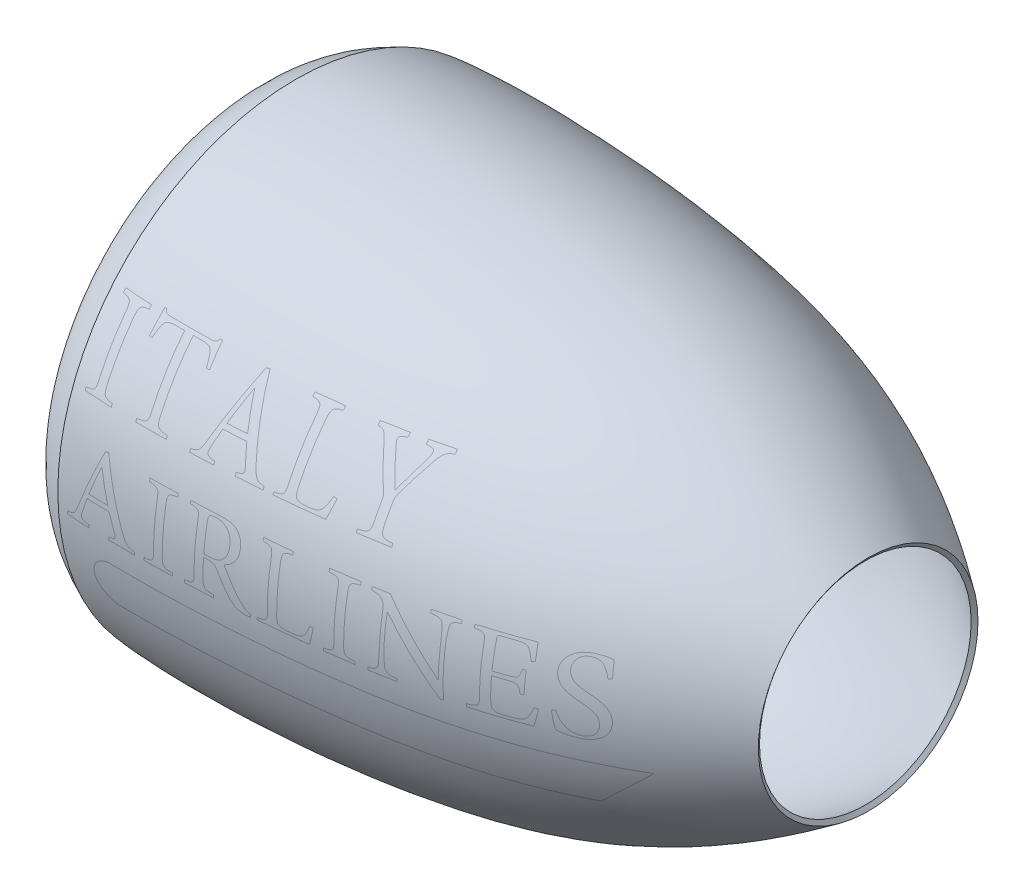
from build123d import *

# Parameters (mm, degrees)
THICKEN1_T1 = 5


with BuildPart() as body_1:
    # Surface-Revolve1: a surface, the sketch's curves turned about an axis
    with BuildLine(Plane.XY, mode=Mode.PRIVATE) as surface_revolve1_1_path:
        Line((61.877398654, 191.649166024), (36.877398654, 191.649166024))
        Line((36.877398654, 191.649166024), (24.686825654, 180))
        Line((24.686825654, 180), (0, 180))
        add(Edge.make_bspline(
            [(0, 180), (-69.149473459, 208.403080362), (0, 237.852169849)],
            knots=[0, 0, 0, 1, 1, 1], degree=2))
        add(Edge.make_bspline(
            [(0, 237.852169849), (49.783819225, 244.473083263), (358.630738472, 242.926541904), (520.974765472, 150.130784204), (580, 108)],
            knots=[0, 0, 0, 0, 0.611317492, 1, 1, 1, 1], degree=3))
    surface_revolve1_1 = Shell.revolve(surface_revolve1_1_path.wire(), 360, Axis((0, 0, 0), (1, 0, 0)))
    add(Solid.thicken(surface_revolve1_1, THICKEN1_T1))


solid = body_1.part
